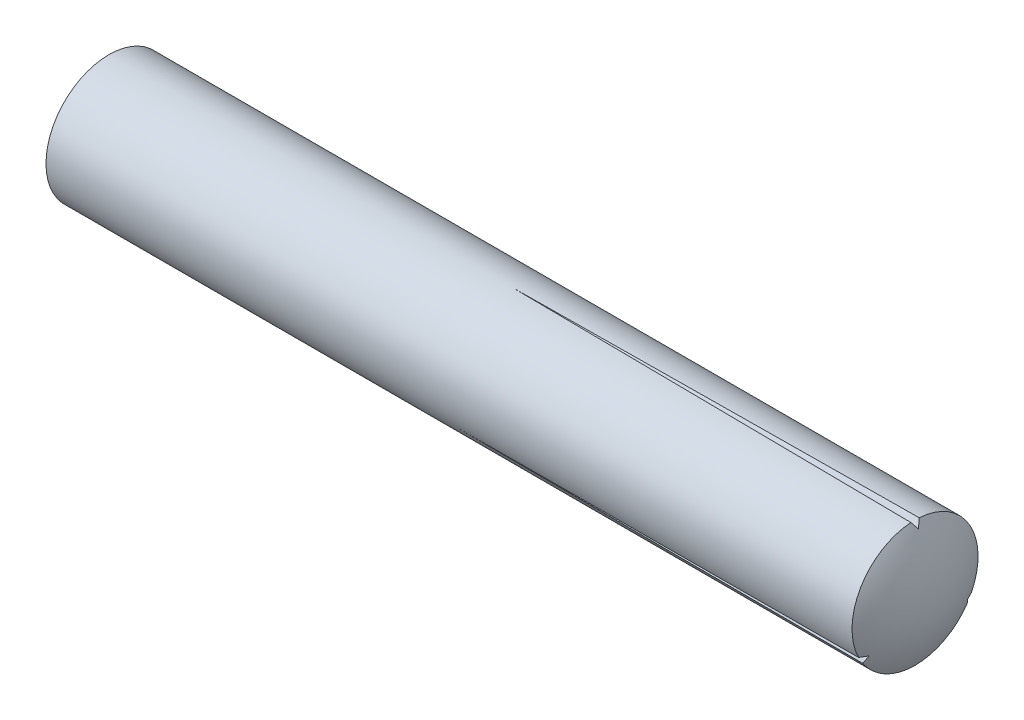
ISO-10303-21;
HEADER;
FILE_DESCRIPTION(('STEP AP214'),'2;1');
FILE_NAME('part.step','',(''),(''),'','','');
FILE_SCHEMA(('AUTOMOTIVE_DESIGN { 1 0 10303 214 1 1 1 1 }'));
ENDSEC;
DATA;
#1=APPLICATION_CONTEXT('core data for automotive mechanical design processes');
#2=APPLICATION_PROTOCOL_DEFINITION('international standard','automotive_design',2000,#1);
#3=PRODUCT_CONTEXT('',#1,'mechanical');
#4=PRODUCT('Part','Part','',(#3));
#5=PRODUCT_RELATED_PRODUCT_CATEGORY('part','',(#4));
#6=PRODUCT_DEFINITION_FORMATION('','',#4);
#7=PRODUCT_DEFINITION_CONTEXT('part definition',#1,'design');
#8=PRODUCT_DEFINITION('design','',#6,#7);
#9=PRODUCT_DEFINITION_SHAPE('','',#8);
#10=(LENGTH_UNIT() NAMED_UNIT(*) SI_UNIT(.MILLI.,.METRE.));
#11=(NAMED_UNIT(*) PLANE_ANGLE_UNIT() SI_UNIT($,.RADIAN.));
#12=(NAMED_UNIT(*) SI_UNIT($,.STERADIAN.) SOLID_ANGLE_UNIT());
#13=UNCERTAINTY_MEASURE_WITH_UNIT(LENGTH_MEASURE(1.E-05),#10,'distance_accuracy_value','');
#14=(GEOMETRIC_REPRESENTATION_CONTEXT(3) GLOBAL_UNCERTAINTY_ASSIGNED_CONTEXT((#13)) GLOBAL_UNIT_ASSIGNED_CONTEXT((#10,
#11,#12)) REPRESENTATION_CONTEXT('',''));
#15=CARTESIAN_POINT('',(0.,0.,0.));
#16=DIRECTION('',(0.,0.,1.));
#17=DIRECTION('',(1.,0.,0.));
#18=AXIS2_PLACEMENT_3D('',#15,#16,#17);
#19=CARTESIAN_POINT('',(8.5,0.,0.));
#20=DIRECTION('',(-1.,0.,0.));
#21=DIRECTION('',(0.,1.,0.));
#22=AXIS2_PLACEMENT_3D('',#19,#20,#21);
#23=SPHERICAL_SURFACE('',#22,1.5);
#24=CARTESIAN_POINT('',(8.50344180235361,0.169064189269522,-0.362559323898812));
#25=DIRECTION('',(0.00860332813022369,0.422602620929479,-0.906274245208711));
#26=DIRECTION('',(0.,0.906307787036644,0.422618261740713));
#27=AXIS2_PLACEMENT_3D('',#24,#25,#26);
#28=CIRCLE('',#27,1.44566807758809);
#29=CARTESIAN_POINT('',(9.83831799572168,-0.338712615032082,-0.586667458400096));
#30=VERTEX_POINT('',#29);
#31=CARTESIAN_POINT('',(9.79903810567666,-0.416859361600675,-0.623480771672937));
#32=VERTEX_POINT('',#31);
#33=EDGE_CURVE('E91',#30,#32,#28,.T.);
#34=ORIENTED_EDGE('',*,*,#33,.F.);
#35=CARTESIAN_POINT('',(8.50344180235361,-0.398517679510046,-0.0348657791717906));
#36=DIRECTION('',(0.00860332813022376,-0.996157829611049,-0.087152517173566));
#37=DIRECTION('',(0.,0.0871557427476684,-0.996194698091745));
#38=AXIS2_PLACEMENT_3D('',#35,#36,#37);
#39=CIRCLE('',#38,1.44566807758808);
#40=CARTESIAN_POINT('',(9.79903810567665,-0.331520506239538,-0.672751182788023));
#41=VERTEX_POINT('',#40);
#42=EDGE_CURVE('E84',#41,#30,#39,.T.);
#43=ORIENTED_EDGE('',*,*,#42,.F.);
#44=CARTESIAN_POINT('',(9.79903810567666,0.,0.));
#45=DIRECTION('',(-1.,0.,0.));
#46=DIRECTION('',(0.,-1.,0.));
#47=AXIS2_PLACEMENT_3D('',#44,#45,#46);
#48=CIRCLE('',#47,0.750000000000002);
#49=CARTESIAN_POINT('',(9.79903810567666,0.748379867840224,-0.0492704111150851));
#50=VERTEX_POINT('',#49);
#51=EDGE_CURVE('E118',#50,#41,#48,.T.);
#52=ORIENTED_EDGE('',*,*,#51,.F.);
#53=CARTESIAN_POINT('',(8.50344180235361,0.229453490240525,0.32769354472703));
#54=DIRECTION('',(0.00860332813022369,0.573555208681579,0.819121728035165));
#55=DIRECTION('',(0.,-0.819152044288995,0.573576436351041));
#56=AXIS2_PLACEMENT_3D('',#53,#54,#55);
#57=CIRCLE('',#56,1.44566807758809);
#58=CARTESIAN_POINT('',(9.83831799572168,0.677425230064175,0.));
#59=VERTEX_POINT('',#58);
#60=EDGE_CURVE('E112',#59,#50,#57,.T.);
#61=ORIENTED_EDGE('',*,*,#60,.F.);
#62=CARTESIAN_POINT('',(8.50344180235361,0.229453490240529,-0.327693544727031));
#63=DIRECTION('',(0.00860332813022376,0.573555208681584,-0.819121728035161));
#64=DIRECTION('',(0.,0.819152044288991,0.573576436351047));
#65=AXIS2_PLACEMENT_3D('',#62,#63,#64);
#66=CIRCLE('',#65,1.44566807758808);
#67=CARTESIAN_POINT('',(9.79903810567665,0.748379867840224,0.0492704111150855));
#68=VERTEX_POINT('',#67);
#69=EDGE_CURVE('E110',#68,#59,#66,.T.);
#70=ORIENTED_EDGE('',*,*,#69,.F.);
#71=CARTESIAN_POINT('',(9.79903810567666,-0.331520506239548,0.672751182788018));
#72=VERTEX_POINT('',#71);
#73=EDGE_CURVE('E117',#72,#68,#48,.T.);
#74=ORIENTED_EDGE('',*,*,#73,.F.);
#75=CARTESIAN_POINT('',(8.50344180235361,-0.398517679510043,0.0348657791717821));
#76=DIRECTION('',(0.00860332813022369,-0.996157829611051,0.0871525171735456));
#77=DIRECTION('',(0.,-0.0871557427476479,-0.996194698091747));
#78=AXIS2_PLACEMENT_3D('',#75,#76,#77);
#79=CIRCLE('',#78,1.44566807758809);
#80=CARTESIAN_POINT('',(9.83831799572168,-0.33871261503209,0.586667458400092));
#81=VERTEX_POINT('',#80);
#82=EDGE_CURVE('E105',#81,#72,#79,.T.);
#83=ORIENTED_EDGE('',*,*,#82,.F.);
#84=CARTESIAN_POINT('',(8.50344180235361,0.169064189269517,0.362559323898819));
#85=DIRECTION('',(0.00860332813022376,0.422602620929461,0.90627424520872));
#86=DIRECTION('',(0.,-0.906307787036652,0.422618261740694));
#87=AXIS2_PLACEMENT_3D('',#84,#85,#86);
#88=CIRCLE('',#87,1.44566807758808);
#89=CARTESIAN_POINT('',(9.79903810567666,-0.416859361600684,0.623480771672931));
#90=VERTEX_POINT('',#89);
#91=EDGE_CURVE('E101',#90,#81,#88,.T.);
#92=ORIENTED_EDGE('',*,*,#91,.F.);
#93=EDGE_CURVE('E99',#32,#90,#48,.T.);
#94=ORIENTED_EDGE('',*,*,#93,.F.);
#95=EDGE_LOOP('',(#34,#43,#52,#61,#70,#74,#83,#92,#94));
#96=FACE_BOUND('',#95,.T.);
#97=ADVANCED_FACE('F33',(#96),#23,.T.);
#98=CARTESIAN_POINT('',(-11.7495518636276,0.,0.));
#99=DIRECTION('',(-1.,0.,0.));
#100=DIRECTION('',(0.,-1.,0.));
#101=AXIS2_PLACEMENT_3D('',#98,#99,#100);
#102=CYLINDRICAL_SURFACE('',#101,0.750000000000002);
#103=CARTESIAN_POINT('',(0.200961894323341,0.,0.));
#104=DIRECTION('',(-1.,0.,0.));
#105=DIRECTION('',(0.,-1.,0.));
#106=AXIS2_PLACEMENT_3D('',#103,#104,#105);
#107=CIRCLE('',#106,0.750000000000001);
#108=CARTESIAN_POINT('',(0.200961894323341,-0.750000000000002,0.));
#109=VERTEX_POINT('',#108);
#110=EDGE_CURVE('E114',#109,#109,#107,.T.);
#111=ORIENTED_EDGE('',*,*,#110,.F.);
#112=EDGE_LOOP('',(#111));
#113=FACE_BOUND('',#112,.T.);
#114=CARTESIAN_POINT('',(55.,0.,0.));
#115=DIRECTION('',(0.00860332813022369,0.422602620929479,-0.906274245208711));
#116=DIRECTION('',(-0.999962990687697,0.00363592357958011,-0.00779726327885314));
#117=AXIS2_PLACEMENT_3D('',#114,#115,#116);
#118=ELLIPSE('',#117,87.1755660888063,0.750000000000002);
#119=CARTESIAN_POINT('',(5.,-0.374999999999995,-0.649519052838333));
#120=VERTEX_POINT('',#119);
#121=EDGE_CURVE('E11',#32,#120,#118,.T.);
#122=ORIENTED_EDGE('',*,*,#121,.F.);
#123=ORIENTED_EDGE('',*,*,#93,.T.);
#124=CARTESIAN_POINT('',(55.0000000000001,0.,0.));
#125=DIRECTION('',(0.00860332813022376,0.422602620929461,0.90627424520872));
#126=DIRECTION('',(-0.999962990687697,0.00363592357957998,0.00779726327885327));
#127=AXIS2_PLACEMENT_3D('',#124,#125,#126);
#128=ELLIPSE('',#127,87.1755660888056,0.750000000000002);
#129=CARTESIAN_POINT('',(5.,-0.375000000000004,0.649519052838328));
#130=VERTEX_POINT('',#129);
#131=EDGE_CURVE('E126',#130,#90,#128,.T.);
#132=ORIENTED_EDGE('',*,*,#131,.F.);
#133=CARTESIAN_POINT('',(54.9999999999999,0.,0.));
#134=DIRECTION('',(0.00860332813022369,-0.996157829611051,0.0871525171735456));
#135=DIRECTION('',(-0.999962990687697,-0.00857058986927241,0.000749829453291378));
#136=AXIS2_PLACEMENT_3D('',#133,#134,#135);
#137=ELLIPSE('',#136,87.1755660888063,0.750000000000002);
#138=EDGE_CURVE('E128',#72,#130,#137,.T.);
#139=ORIENTED_EDGE('',*,*,#138,.F.);
#140=ORIENTED_EDGE('',*,*,#73,.T.);
#141=CARTESIAN_POINT('',(55.0000000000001,0.,0.));
#142=DIRECTION('',(0.00860332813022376,0.573555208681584,-0.819121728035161));
#143=DIRECTION('',(-0.999962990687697,0.00493466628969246,-0.00704743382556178));
#144=AXIS2_PLACEMENT_3D('',#141,#142,#143);
#145=ELLIPSE('',#144,87.1755660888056,0.750000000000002);
#146=CARTESIAN_POINT('',(5.,0.75,0.));
#147=VERTEX_POINT('',#146);
#148=EDGE_CURVE('E120',#147,#68,#145,.T.);
#149=ORIENTED_EDGE('',*,*,#148,.F.);
#150=CARTESIAN_POINT('',(55.0000000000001,0.,0.));
#151=DIRECTION('',(0.00860332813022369,0.573555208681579,0.819121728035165));
#152=DIRECTION('',(-0.999962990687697,0.00493466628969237,0.00704743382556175));
#153=AXIS2_PLACEMENT_3D('',#150,#151,#152);
#154=ELLIPSE('',#153,87.1755660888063,0.750000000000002);
#155=EDGE_CURVE('E123',#50,#147,#154,.T.);
#156=ORIENTED_EDGE('',*,*,#155,.F.);
#157=ORIENTED_EDGE('',*,*,#51,.T.);
#158=CARTESIAN_POINT('',(54.9999999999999,0.,0.));
#159=DIRECTION('',(0.00860332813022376,-0.996157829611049,-0.087152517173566));
#160=DIRECTION('',(-0.999962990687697,-0.00857058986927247,-0.000749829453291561));
#161=AXIS2_PLACEMENT_3D('',#158,#159,#160);
#162=ELLIPSE('',#161,87.1755660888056,0.750000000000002);
#163=EDGE_CURVE('E41',#120,#41,#162,.T.);
#164=ORIENTED_EDGE('',*,*,#163,.F.);
#165=EDGE_LOOP('',(#122,#123,#132,#139,#140,#149,#156,#157,#164));
#166=FACE_BOUND('',#165,.T.);
#167=ADVANCED_FACE('F136',(#113,#166),#102,.T.);
#168=CARTESIAN_POINT('',(1.5,0.,0.));
#169=DIRECTION('',(-1.,0.,0.));
#170=DIRECTION('',(0.,1.,0.));
#171=AXIS2_PLACEMENT_3D('',#168,#169,#170);
#172=SPHERICAL_SURFACE('',#171,1.5);
#173=ORIENTED_EDGE('',*,*,#110,.T.);
#174=EDGE_LOOP('',(#173));
#175=FACE_BOUND('',#174,.T.);
#176=ADVANCED_FACE('F35',(#175),#172,.T.);
#177=CARTESIAN_POINT('',(10.,0.75,-0.0525155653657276));
#178=DIRECTION('',(0.00860332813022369,0.573555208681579,0.819121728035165));
#179=DIRECTION('',(0.,-0.819152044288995,0.573576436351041));
#180=AXIS2_PLACEMENT_3D('',#177,#178,#179);
#181=PLANE('',#180);
#182=ORIENTED_EDGE('',*,*,#60,.T.);
#183=ORIENTED_EDGE('',*,*,#155,.T.);
#184=DIRECTION('',(0.999887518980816,-0.0149983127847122,0.));
#185=VECTOR('',#184,1.);
#186=CARTESIAN_POINT('',(5.,0.75,0.));
#187=LINE('',#186,#185);
#188=EDGE_CURVE('E107',#147,#59,#187,.T.);
#189=ORIENTED_EDGE('',*,*,#188,.T.);
#190=EDGE_LOOP('',(#182,#183,#189));
#191=FACE_BOUND('',#190,.T.);
#192=ADVANCED_FACE('F145',(#191),#181,.T.);
#193=CARTESIAN_POINT('',(10.,0.675,0.));
#194=DIRECTION('',(0.00860332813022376,0.573555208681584,-0.819121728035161));
#195=DIRECTION('',(0.,0.819152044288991,0.573576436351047));
#196=AXIS2_PLACEMENT_3D('',#193,#194,#195);
#197=PLANE('',#196);
#198=ORIENTED_EDGE('',*,*,#69,.T.);
#199=ORIENTED_EDGE('',*,*,#188,.F.);
#200=ORIENTED_EDGE('',*,*,#148,.T.);
#201=EDGE_LOOP('',(#198,#199,#200));
#202=FACE_BOUND('',#201,.T.);
#203=ADVANCED_FACE('F143',(#202),#197,.T.);
#204=CARTESIAN_POINT('',(10.,-0.329520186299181,0.675776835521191));
#205=DIRECTION('',(0.00860332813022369,-0.996157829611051,0.0871525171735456));
#206=DIRECTION('',(0.,-0.0871557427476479,-0.996194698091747));
#207=AXIS2_PLACEMENT_3D('',#204,#205,#206);
#208=PLANE('',#207);
#209=ORIENTED_EDGE('',*,*,#82,.T.);
#210=ORIENTED_EDGE('',*,*,#138,.T.);
#211=DIRECTION('',(0.999887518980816,0.00749915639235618,-0.0129889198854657));
#212=VECTOR('',#211,1.);
#213=CARTESIAN_POINT('',(5.,-0.375000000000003,0.649519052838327));
#214=LINE('',#213,#212);
#215=EDGE_CURVE('E55',#130,#81,#214,.T.);
#216=ORIENTED_EDGE('',*,*,#215,.T.);
#217=EDGE_LOOP('',(#209,#210,#216));
#218=FACE_BOUND('',#217,.T.);
#219=ADVANCED_FACE('F132',(#218),#208,.T.);
#220=CARTESIAN_POINT('',(10.,-0.337500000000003,0.584567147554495));
#221=DIRECTION('',(0.00860332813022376,0.422602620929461,0.90627424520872));
#222=DIRECTION('',(0.,-0.906307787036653,0.422618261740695));
#223=AXIS2_PLACEMENT_3D('',#220,#221,#222);
#224=PLANE('',#223);
#225=ORIENTED_EDGE('',*,*,#91,.T.);
#226=ORIENTED_EDGE('',*,*,#215,.F.);
#227=ORIENTED_EDGE('',*,*,#131,.T.);
#228=EDGE_LOOP('',(#225,#226,#227));
#229=FACE_BOUND('',#228,.T.);
#230=ADVANCED_FACE('F137',(#229),#224,.T.);
#231=CARTESIAN_POINT('',(10.,-0.420479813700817,-0.623261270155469));
#232=DIRECTION('',(0.00860332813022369,0.422602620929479,-0.906274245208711));
#233=DIRECTION('',(0.,0.906307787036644,0.422618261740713));
#234=AXIS2_PLACEMENT_3D('',#231,#232,#233);
#235=PLANE('',#234);
#236=ORIENTED_EDGE('',*,*,#33,.T.);
#237=ORIENTED_EDGE('',*,*,#121,.T.);
#238=DIRECTION('',(0.999887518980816,0.00749915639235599,0.0129889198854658));
#239=VECTOR('',#238,1.);
#240=CARTESIAN_POINT('',(5.,-0.374999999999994,-0.649519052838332));
#241=LINE('',#240,#239);
#242=EDGE_CURVE('E48',#120,#30,#241,.T.);
#243=ORIENTED_EDGE('',*,*,#242,.T.);
#244=EDGE_LOOP('',(#236,#237,#243));
#245=FACE_BOUND('',#244,.T.);
#246=ADVANCED_FACE('F94',(#245),#235,.T.);
#247=CARTESIAN_POINT('',(10.,-0.337499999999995,-0.584567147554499));
#248=DIRECTION('',(0.00860332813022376,-0.996157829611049,-0.087152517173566));
#249=DIRECTION('',(0.,0.0871557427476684,-0.996194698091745));
#250=AXIS2_PLACEMENT_3D('',#247,#248,#249);
#251=PLANE('',#250);
#252=ORIENTED_EDGE('',*,*,#42,.T.);
#253=ORIENTED_EDGE('',*,*,#242,.F.);
#254=ORIENTED_EDGE('',*,*,#163,.T.);
#255=EDGE_LOOP('',(#252,#253,#254));
#256=FACE_BOUND('',#255,.T.);
#257=ADVANCED_FACE('F85',(#256),#251,.T.);
#258=CLOSED_SHELL('',(#97,#167,#176,#192,#203,#219,#230,#246,#257));
#259=MANIFOLD_SOLID_BREP('B2',#258);
#260=ADVANCED_BREP_SHAPE_REPRESENTATION('',(#18,#259),#14);
#261=SHAPE_DEFINITION_REPRESENTATION(#9,#260);
ENDSEC;
END-ISO-10303-21;
